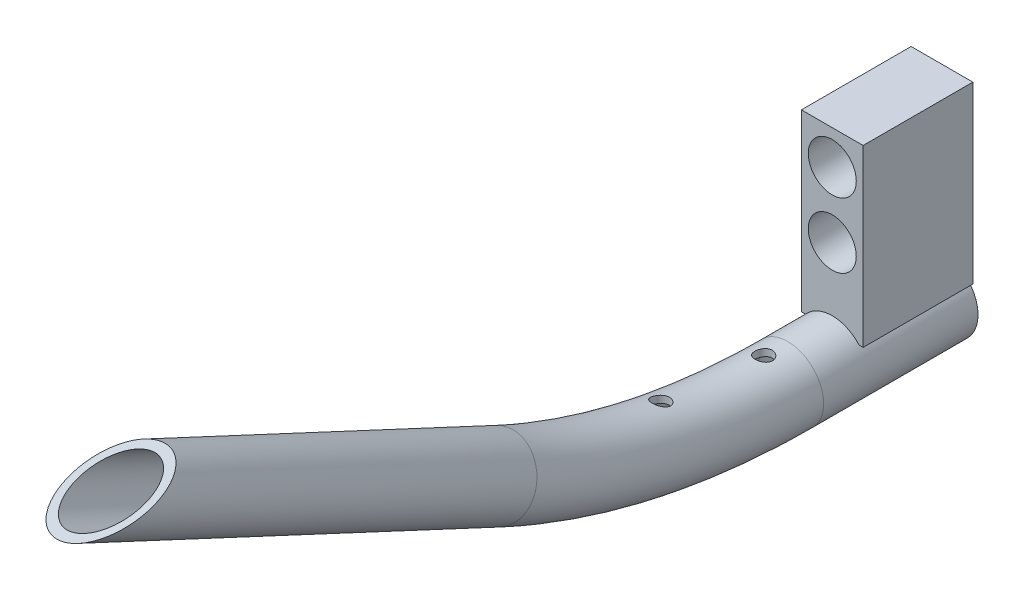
ISO-10303-21;
HEADER;
FILE_DESCRIPTION(('STEP AP214'),'2;1');
FILE_NAME('part.step','',(''),(''),'','','');
FILE_SCHEMA(('AUTOMOTIVE_DESIGN { 1 0 10303 214 1 1 1 1 }'));
ENDSEC;
DATA;
#1=APPLICATION_CONTEXT('core data for automotive mechanical design processes');
#2=APPLICATION_PROTOCOL_DEFINITION('international standard','automotive_design',2000,#1);
#3=PRODUCT_CONTEXT('',#1,'mechanical');
#4=PRODUCT('Part','Part','',(#3));
#5=PRODUCT_RELATED_PRODUCT_CATEGORY('part','',(#4));
#6=PRODUCT_DEFINITION_FORMATION('','',#4);
#7=PRODUCT_DEFINITION_CONTEXT('part definition',#1,'design');
#8=PRODUCT_DEFINITION('design','',#6,#7);
#9=PRODUCT_DEFINITION_SHAPE('','',#8);
#10=(LENGTH_UNIT() NAMED_UNIT(*) SI_UNIT(.MILLI.,.METRE.));
#11=(NAMED_UNIT(*) PLANE_ANGLE_UNIT() SI_UNIT($,.RADIAN.));
#12=(NAMED_UNIT(*) SI_UNIT($,.STERADIAN.) SOLID_ANGLE_UNIT());
#13=UNCERTAINTY_MEASURE_WITH_UNIT(LENGTH_MEASURE(1.E-05),#10,'distance_accuracy_value','');
#14=(GEOMETRIC_REPRESENTATION_CONTEXT(3) GLOBAL_UNCERTAINTY_ASSIGNED_CONTEXT((#13)) GLOBAL_UNIT_ASSIGNED_CONTEXT((#10,
#11,#12)) REPRESENTATION_CONTEXT('',''));
#15=CARTESIAN_POINT('',(0.,0.,0.));
#16=DIRECTION('',(0.,0.,1.));
#17=DIRECTION('',(1.,0.,0.));
#18=AXIS2_PLACEMENT_3D('',#15,#16,#17);
#19=CARTESIAN_POINT('',(0.,29.,32.));
#20=DIRECTION('',(0.,0.,-1.));
#21=DIRECTION('',(-1.,0.,0.));
#22=AXIS2_PLACEMENT_3D('',#19,#20,#21);
#23=CYLINDRICAL_SURFACE('',#22,4.25);
#24=CARTESIAN_POINT('',(0.,29.,0.));
#25=DIRECTION('',(0.,0.,-1.));
#26=DIRECTION('',(-1.,0.,0.));
#27=AXIS2_PLACEMENT_3D('',#24,#25,#26);
#28=CIRCLE('',#27,4.25);
#29=CARTESIAN_POINT('',(-4.25,29.,0.));
#30=VERTEX_POINT('',#29);
#31=EDGE_CURVE('E418',#30,#30,#28,.T.);
#32=ORIENTED_EDGE('',*,*,#31,.T.);
#33=EDGE_LOOP('',(#32));
#34=FACE_BOUND('',#33,.T.);
#35=CARTESIAN_POINT('',(0.,29.,21.));
#36=DIRECTION('',(0.,0.,1.));
#37=DIRECTION('',(1.,0.,0.));
#38=AXIS2_PLACEMENT_3D('',#35,#36,#37);
#39=CIRCLE('',#38,4.25);
#40=CARTESIAN_POINT('',(4.25,29.,21.));
#41=VERTEX_POINT('',#40);
#42=EDGE_CURVE('E39',#41,#41,#39,.F.);
#43=ORIENTED_EDGE('',*,*,#42,.F.);
#44=EDGE_LOOP('',(#43));
#45=FACE_BOUND('',#44,.T.);
#46=ADVANCED_FACE('F35',(#34,#45),#23,.F.);
#47=CARTESIAN_POINT('',(0.,48.,32.));
#48=DIRECTION('',(0.,0.,-1.));
#49=DIRECTION('',(-1.,0.,0.));
#50=AXIS2_PLACEMENT_3D('',#47,#48,#49);
#51=CYLINDRICAL_SURFACE('',#50,4.25);
#52=CARTESIAN_POINT('',(0.,48.,0.));
#53=DIRECTION('',(0.,0.,-1.));
#54=DIRECTION('',(-1.,0.,0.));
#55=AXIS2_PLACEMENT_3D('',#52,#53,#54);
#56=CIRCLE('',#55,4.25);
#57=CARTESIAN_POINT('',(-4.25,48.,0.));
#58=VERTEX_POINT('',#57);
#59=EDGE_CURVE('E126',#58,#58,#56,.T.);
#60=ORIENTED_EDGE('',*,*,#59,.T.);
#61=EDGE_LOOP('',(#60));
#62=FACE_BOUND('',#61,.T.);
#63=CARTESIAN_POINT('',(0.,48.,21.));
#64=DIRECTION('',(0.,0.,1.));
#65=DIRECTION('',(1.,0.,0.));
#66=AXIS2_PLACEMENT_3D('',#63,#64,#65);
#67=CIRCLE('',#66,4.25);
#68=CARTESIAN_POINT('',(4.25,48.,21.));
#69=VERTEX_POINT('',#68);
#70=EDGE_CURVE('E178',#69,#69,#67,.F.);
#71=ORIENTED_EDGE('',*,*,#70,.F.);
#72=EDGE_LOOP('',(#71));
#73=FACE_BOUND('',#72,.T.);
#74=ADVANCED_FACE('F206',(#62,#73),#51,.F.);
#75=CARTESIAN_POINT('',(0.,200.,45.));
#76=DIRECTION('',(-1.,0.,0.));
#77=DIRECTION('',(0.,0.,1.));
#78=AXIS2_PLACEMENT_3D('',#75,#76,#77);
#79=TOROIDAL_SURFACE('',#78,200.,10.5);
#80=CARTESIAN_POINT('',(-1.39813810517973,13.6514963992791,79.9275111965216));
#81=CARTESIAN_POINT('',(-1.28168632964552,13.6526883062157,79.8489556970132));
#82=CARTESIAN_POINT('',(-1.15856044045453,13.6546418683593,79.7802105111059));
#83=CARTESIAN_POINT('',(-0.902464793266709,13.6587415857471,79.664333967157));
#84=CARTESIAN_POINT('',(-0.769488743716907,13.6608878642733,79.6172165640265));
#85=CARTESIAN_POINT('',(-0.497524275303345,13.6643846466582,79.5459789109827));
#86=CARTESIAN_POINT('',(-0.358537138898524,13.6657353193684,79.5218537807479));
#87=CARTESIAN_POINT('',(-0.0785007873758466,13.6671125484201,79.4972830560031));
#88=CARTESIAN_POINT('',(0.0625481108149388,13.6671393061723,79.4968338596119));
#89=CARTESIAN_POINT('',(0.342558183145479,13.6658600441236,79.5196042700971));
#90=CARTESIAN_POINT('',(0.481521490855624,13.6645554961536,79.5427977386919));
#91=CARTESIAN_POINT('',(0.75358830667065,13.6611234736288,79.612152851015));
#92=CARTESIAN_POINT('',(0.886691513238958,13.6589959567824,79.6583156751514));
#93=CARTESIAN_POINT('',(1.14338690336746,13.6548833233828,79.7723537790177));
#94=CARTESIAN_POINT('',(1.26697083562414,13.6528983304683,79.8402476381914));
#95=CARTESIAN_POINT('',(1.50100723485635,13.6503912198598,79.9958242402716));
#96=CARTESIAN_POINT('',(1.61145962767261,13.6498691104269,80.0835070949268));
#97=CARTESIAN_POINT('',(1.81594445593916,13.6517922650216,80.2760394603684));
#98=CARTESIAN_POINT('',(1.90999729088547,13.6542338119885,80.3808673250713));
#99=CARTESIAN_POINT('',(2.07912017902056,13.6635556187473,80.6046771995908));
#100=CARTESIAN_POINT('',(2.1541927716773,13.6704352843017,80.7236573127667));
#101=CARTESIAN_POINT('',(2.28236825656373,13.6897111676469,80.9704958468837));
#102=CARTESIAN_POINT('',(2.33574869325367,13.7020331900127,81.0982159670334));
#103=CARTESIAN_POINT('',(2.42060941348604,13.7328475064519,81.3600131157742));
#104=CARTESIAN_POINT('',(2.45209144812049,13.7513393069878,81.4940896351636));
#105=CARTESIAN_POINT('',(2.49250774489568,13.7943819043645,81.763657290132));
#106=CARTESIAN_POINT('',(2.501595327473,13.8188902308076,81.8991323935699));
#107=CARTESIAN_POINT('',(2.4979451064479,13.8734217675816,82.1686573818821));
#108=CARTESIAN_POINT('',(2.48520398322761,13.9034458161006,82.3027070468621));
#109=CARTESIAN_POINT('',(2.43805972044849,13.9688062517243,82.5699271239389));
#110=CARTESIAN_POINT('',(2.40302523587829,14.0042737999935,82.7029535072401));
#111=CARTESIAN_POINT('',(2.31204859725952,14.0781205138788,82.9608009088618));
#112=CARTESIAN_POINT('',(2.25609993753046,14.116500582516,83.0856193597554));
#113=CARTESIAN_POINT('',(2.12133130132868,14.1962110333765,83.3306064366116));
#114=CARTESIAN_POINT('',(2.04146028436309,14.2375902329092,83.4501821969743));
#115=CARTESIAN_POINT('',(1.86210416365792,14.3187706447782,83.6742672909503));
#116=CARTESIAN_POINT('',(1.76261423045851,14.3585714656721,83.7787729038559));
#117=CARTESIAN_POINT('',(1.54460152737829,14.4344133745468,83.9712041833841));
#118=CARTESIAN_POINT('',(1.42582162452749,14.4703909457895,84.0588649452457));
#119=CARTESIAN_POINT('',(1.17320381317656,14.5350119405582,84.2125595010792));
#120=CARTESIAN_POINT('',(1.03937310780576,14.5636588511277,84.2786035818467));
#121=CARTESIAN_POINT('',(0.769036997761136,14.6095589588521,84.3829128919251));
#122=CARTESIAN_POINT('',(0.633192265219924,14.6274003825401,84.4226263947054));
#123=CARTESIAN_POINT('',(0.35583664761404,14.652673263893,84.4785797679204));
#124=CARTESIAN_POINT('',(0.214329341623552,14.6601111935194,84.4948342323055));
#125=CARTESIAN_POINT('',(-0.0581741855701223,14.663721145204,84.5027392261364));
#126=CARTESIAN_POINT('',(-0.189109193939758,14.6607438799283,84.4962475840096));
#127=CARTESIAN_POINT('',(-0.447825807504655,14.6456389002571,84.4630178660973));
#128=CARTESIAN_POINT('',(-0.57560762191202,14.6335117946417,84.4362811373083));
#129=CARTESIAN_POINT('',(-0.822876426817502,14.6012950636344,84.3641610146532));
#130=CARTESIAN_POINT('',(-0.942449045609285,14.5813099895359,84.319022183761));
#131=CARTESIAN_POINT('',(-1.17231403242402,14.5348133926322,84.2117368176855));
#132=CARTESIAN_POINT('',(-1.28260419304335,14.5083003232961,84.149586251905));
#133=CARTESIAN_POINT('',(-1.49829507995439,14.4486205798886,84.0057310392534));
#134=CARTESIAN_POINT('',(-1.60295139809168,14.4151402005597,83.9230420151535));
#135=CARTESIAN_POINT('',(-1.79728431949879,14.3448579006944,83.7427999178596));
#136=CARTESIAN_POINT('',(-1.88695470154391,14.30805461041,83.645240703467));
#137=CARTESIAN_POINT('',(-2.0560521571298,14.2302875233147,83.4293005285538));
#138=CARTESIAN_POINT('',(-2.13411570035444,14.1892243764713,83.3098847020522));
#139=CARTESIAN_POINT('',(-2.268987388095,14.1082006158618,83.059225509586));
#140=CARTESIAN_POINT('',(-2.32579094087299,14.068240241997,82.9279795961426));
#141=CARTESIAN_POINT('',(-2.41751907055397,13.9907620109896,82.653482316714));
#142=CARTESIAN_POINT('',(-2.4518749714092,13.9533277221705,82.5100159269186));
#143=CARTESIAN_POINT('',(-2.49484587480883,13.8840642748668,82.2179627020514));
#144=CARTESIAN_POINT('',(-2.50346943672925,13.8522332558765,82.069377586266));
#145=CARTESIAN_POINT('',(-2.49420329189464,13.7967556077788,81.7779585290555));
#146=CARTESIAN_POINT('',(-2.47741078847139,13.7728216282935,81.635144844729));
#147=CARTESIAN_POINT('',(-2.41925256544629,13.7318592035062,81.3535747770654));
#148=CARTESIAN_POINT('',(-2.37789067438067,13.7148296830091,81.2148177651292));
#149=CARTESIAN_POINT('',(-2.27399225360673,13.6879819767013,80.9521445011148));
#150=CARTESIAN_POINT('',(-2.21250884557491,13.677870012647,80.8278399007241));
#151=CARTESIAN_POINT('',(-2.06969745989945,13.6627532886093,80.5909376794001));
#152=CARTESIAN_POINT('',(-1.98838148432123,13.6577454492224,80.4783330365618));
#153=CARTESIAN_POINT('',(-1.82545092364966,13.6521350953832,80.2881904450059));
#154=CARTESIAN_POINT('',(-1.74685324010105,13.6508743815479,80.2080610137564));
#155=CARTESIAN_POINT('',(-1.57963152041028,13.6500797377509,80.0590447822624));
#156=CARTESIAN_POINT('',(-1.49100714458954,13.6505458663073,79.9901583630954));
#157=CARTESIAN_POINT('',(-1.39813810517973,13.6514963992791,79.9275111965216));
#158=B_SPLINE_CURVE_WITH_KNOTS('',3,(#80,#81,#82,#83,#84,#85,#86,#87,#88,#89,#90,#91,#92,#93,
#94,#95,#96,#97,#98,#99,#100,#101,#102,#103,#104,#105,#106,#107,#108,#109,#110,#111,#112,#113,
#114,#115,#116,#117,#118,#119,#120,#121,#122,#123,#124,#125,#126,#127,#128,#129,#130,#131,#132,
#133,#134,#135,#136,#137,#138,#139,#140,#141,#142,#143,#144,#145,#146,#147,#148,#149,#150,#151,
#152,#153,#154,#155,#156,#157),.UNSPECIFIED.,.T.,.F.,(4,2,2,2,2,2,2,2,2,2,2,2,2,2,2,2,2,2,2,2,2,
2,2,2,2,2,2,2,2,2,2,2,2,2,2,2,2,2,4),(0.,0.421023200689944,0.842317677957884,1.26352271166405,
1.68466366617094,2.10533953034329,2.52603701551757,2.94709515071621,3.36815566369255,
3.78868862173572,4.20916528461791,4.62407850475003,5.03895854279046,5.45099017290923,
5.8630844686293,6.28740262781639,6.71185288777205,7.15869938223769,7.60565601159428,
8.05915098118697,8.51242982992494,8.93806984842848,9.36344496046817,9.75491488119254,
10.1463587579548,10.5327616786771,10.9192562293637,11.330071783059,11.7410574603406,
12.1844213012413,12.6278808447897,13.0821789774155,13.5363259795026,13.971418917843,
14.4064440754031,14.8216050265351,15.236515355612,15.5722654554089,15.9080269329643),.UNSPECIFIED.);
#159=CARTESIAN_POINT('',(-1.39813810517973,13.6514963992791,79.9275111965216));
#160=VERTEX_POINT('',#159);
#161=EDGE_CURVE('E152',#160,#160,#158,.T.);
#162=ORIENTED_EDGE('',*,*,#161,.T.);
#163=EDGE_LOOP('',(#162));
#164=FACE_BOUND('',#163,.T.);
#165=CARTESIAN_POINT('',(0.,0.,45.));
#166=DIRECTION('',(0.,0.,1.));
#167=DIRECTION('',(1.,0.,0.));
#168=AXIS2_PLACEMENT_3D('',#165,#166,#167);
#169=CIRCLE('',#168,10.5);
#170=CARTESIAN_POINT('',(10.5,0.,45.));
#171=VERTEX_POINT('',#170);
#172=EDGE_CURVE('E401',#171,#171,#169,.T.);
#173=ORIENTED_EDGE('',*,*,#172,.T.);
#174=EDGE_LOOP('',(#173));
#175=FACE_BOUND('',#174,.T.);
#176=CARTESIAN_POINT('',(0.,18.73844259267,129.52365234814));
#177=DIRECTION('',(0.,0.4226182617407,0.90630778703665));
#178=DIRECTION('',(1.,0.,0.));
#179=AXIS2_PLACEMENT_3D('',#176,#177,#178);
#180=CIRCLE('',#179,10.5);
#181=CARTESIAN_POINT('',(10.5,18.73844259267,129.52365234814));
#182=VERTEX_POINT('',#181);
#183=EDGE_CURVE('E11',#182,#182,#180,.T.);
#184=ORIENTED_EDGE('',*,*,#183,.F.);
#185=EDGE_LOOP('',(#184));
#186=FACE_BOUND('',#185,.T.);
#187=CARTESIAN_POINT('',(-1.4336009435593,10.4663494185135,49.9518817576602));
#188=CARTESIAN_POINT('',(-1.3198313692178,10.4799526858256,49.872251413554));
#189=CARTESIAN_POINT('',(-1.19932579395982,10.4928678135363,49.8020554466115));
#190=CARTESIAN_POINT('',(-0.948055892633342,10.5157140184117,49.6825539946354));
#191=CARTESIAN_POINT('',(-0.817287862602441,10.5256440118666,49.6332560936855));
#192=CARTESIAN_POINT('',(-0.549032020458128,10.5412908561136,49.5570484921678));
#193=CARTESIAN_POINT('',(-0.411539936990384,10.5470049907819,49.5301532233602));
#194=CARTESIAN_POINT('',(-0.133896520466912,10.5534936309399,49.4996859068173));
#195=CARTESIAN_POINT('',(0.00625436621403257,10.5542689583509,49.4961099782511));
#196=CARTESIAN_POINT('',(0.283272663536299,10.550809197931,49.5122793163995));
#197=CARTESIAN_POINT('',(0.420158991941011,10.5466401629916,49.5317171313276));
#198=CARTESIAN_POINT('',(0.688672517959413,10.5339099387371,49.5927836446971));
#199=CARTESIAN_POINT('',(0.820299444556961,10.5253485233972,49.6344134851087));
#200=CARTESIAN_POINT('',(1.07518301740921,10.5048304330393,49.738800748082));
#201=CARTESIAN_POINT('',(1.19840581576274,10.4928609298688,49.8016381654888));
#202=CARTESIAN_POINT('',(1.4326961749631,10.4669944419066,49.9466207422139));
#203=CARTESIAN_POINT('',(1.5437620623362,10.453097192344,50.0287685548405));
#204=CARTESIAN_POINT('',(1.7529762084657,10.4248018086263,50.2120394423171));
#205=CARTESIAN_POINT('',(1.85081594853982,10.4103992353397,50.3135143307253));
#206=CARTESIAN_POINT('',(2.02817990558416,10.3832894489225,50.5315861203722));
#207=CARTESIAN_POINT('',(2.10770367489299,10.3705822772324,50.6481833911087));
#208=CARTESIAN_POINT('',(2.24630023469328,10.3486671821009,50.8936363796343));
#209=CARTESIAN_POINT('',(2.30532560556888,10.339467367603,51.0225196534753));
#210=CARTESIAN_POINT('',(2.40081780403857,10.3261361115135,51.2886303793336));
#211=CARTESIAN_POINT('',(2.43728912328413,10.3220036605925,51.4258561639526));
#212=CARTESIAN_POINT('',(2.4859163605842,10.319798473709,51.7011837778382));
#213=CARTESIAN_POINT('',(2.4986368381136,10.321582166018,51.8391848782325));
#214=CARTESIAN_POINT('',(2.50115489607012,10.3311171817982,52.1151794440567));
#215=CARTESIAN_POINT('',(2.49095412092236,10.3388680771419,52.253172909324));
#216=CARTESIAN_POINT('',(2.44835517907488,10.3597152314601,52.5235035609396));
#217=CARTESIAN_POINT('',(2.41623092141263,10.3727447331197,52.6558893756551));
#218=CARTESIAN_POINT('',(2.33116145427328,10.4030692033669,52.9132714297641));
#219=CARTESIAN_POINT('',(2.27821336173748,10.4203647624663,53.0382666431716));
#220=CARTESIAN_POINT('',(2.15157132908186,10.4581549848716,53.2805731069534));
#221=CARTESIAN_POINT('',(2.07741747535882,10.4787154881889,53.3976335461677));
#222=CARTESIAN_POINT('',(1.91093344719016,10.5208374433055,53.6178360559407));
#223=CARTESIAN_POINT('',(1.81859976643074,10.5423990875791,53.7209754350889));
#224=CARTESIAN_POINT('',(1.61527505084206,10.5851161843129,53.9133770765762));
#225=CARTESIAN_POINT('',(1.50383662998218,10.6062436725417,54.0021737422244));
#226=CARTESIAN_POINT('',(1.26711416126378,10.6453459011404,54.1597767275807));
#227=CARTESIAN_POINT('',(1.14183092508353,10.6633208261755,54.2285842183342));
#228=CARTESIAN_POINT('',(0.882120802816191,10.6941155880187,54.3434636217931));
#229=CARTESIAN_POINT('',(0.747795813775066,10.70698432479,54.389752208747));
#230=CARTESIAN_POINT('',(0.472827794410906,10.7264570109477,54.458967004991));
#231=CARTESIAN_POINT('',(0.332186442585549,10.7330626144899,54.4818993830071));
#232=CARTESIAN_POINT('',(0.0539481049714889,10.7391870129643,54.5031708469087));
#233=CARTESIAN_POINT('',(-0.083579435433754,10.7389493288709,54.5023550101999));
#234=CARTESIAN_POINT('',(-0.356472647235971,10.7320132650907,54.4782427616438));
#235=CARTESIAN_POINT('',(-0.491838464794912,10.7253153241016,54.4549478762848));
#236=CARTESIAN_POINT('',(-0.754984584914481,10.706250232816,54.3871007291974));
#237=CARTESIAN_POINT('',(-0.88283527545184,10.6939505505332,54.3428011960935));
#238=CARTESIAN_POINT('',(-1.12931990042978,10.664881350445,54.2344503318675));
#239=CARTESIAN_POINT('',(-1.24795251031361,10.6481111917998,54.1703961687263));
#240=CARTESIAN_POINT('',(-1.47619674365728,10.6111395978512,54.0223385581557));
#241=CARTESIAN_POINT('',(-1.58547034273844,10.5908564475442,53.9378347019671));
#242=CARTESIAN_POINT('',(-1.78854439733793,10.5490959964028,53.7521550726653));
#243=CARTESIAN_POINT('',(-1.88234161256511,10.5276184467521,53.6509758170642));
#244=CARTESIAN_POINT('',(-2.05471042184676,10.4848013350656,53.4311725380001));
#245=CARTESIAN_POINT('',(-2.13273149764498,10.4634858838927,53.3121111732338));
#246=CARTESIAN_POINT('',(-2.26762200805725,10.4237563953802,53.0621021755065));
#247=CARTESIAN_POINT('',(-2.32449250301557,10.4053422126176,52.9311551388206));
#248=CARTESIAN_POINT('',(-2.41491999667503,10.3733071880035,52.6619457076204));
#249=CARTESIAN_POINT('',(-2.44864401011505,10.3596523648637,52.5237436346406));
#250=CARTESIAN_POINT('',(-2.49218697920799,10.3381829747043,52.2431912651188));
#251=CARTESIAN_POINT('',(-2.5020119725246,10.3303669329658,52.100842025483));
#252=CARTESIAN_POINT('',(-2.49737849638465,10.3212342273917,51.8209548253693));
#253=CARTESIAN_POINT('',(-2.4836949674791,10.3197155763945,51.6834101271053));
#254=CARTESIAN_POINT('',(-2.43388724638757,10.3223666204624,51.4124963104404));
#255=CARTESIAN_POINT('',(-2.39776171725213,10.3265366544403,51.2791274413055));
#256=CARTESIAN_POINT('',(-2.30457426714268,10.3395994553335,51.0214498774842));
#257=CARTESIAN_POINT('',(-2.24768896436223,10.3484526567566,50.8970750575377));
#258=CARTESIAN_POINT('',(-2.11460540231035,10.3694860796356,50.6594872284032));
#259=CARTESIAN_POINT('',(-2.03841306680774,10.3816652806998,50.5462708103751));
#260=CARTESIAN_POINT('',(-1.87914893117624,10.4061123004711,50.3468048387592));
#261=CARTESIAN_POINT('',(-1.79804516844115,10.4181886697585,50.2589503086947));
#262=CARTESIAN_POINT('',(-1.62415290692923,10.4424625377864,50.0957019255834));
#263=CARTESIAN_POINT('',(-1.53136388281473,10.4546600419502,50.0203086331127));
#264=CARTESIAN_POINT('',(-1.4336009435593,10.4663494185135,49.9518817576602));
#265=B_SPLINE_CURVE_WITH_KNOTS('',3,(#187,#188,#189,#190,#191,#192,#193,#194,#195,#196,#197,
#198,#199,#200,#201,#202,#203,#204,#205,#206,#207,#208,#209,#210,#211,#212,#213,#214,#215,#216,
#217,#218,#219,#220,#221,#222,#223,#224,#225,#226,#227,#228,#229,#230,#231,#232,#233,#234,#235,
#236,#237,#238,#239,#240,#241,#242,#243,#244,#245,#246,#247,#248,#249,#250,#251,#252,#253,#254,
#255,#256,#257,#258,#259,#260,#261,#262,#263,#264),.UNSPECIFIED.,.T.,.F.,(4,2,2,2,2,2,2,2,2,2,2,
2,2,2,2,2,2,2,2,2,2,2,2,2,2,2,2,2,2,2,2,2,2,2,2,2,2,2,4),(0.,0.418182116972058,
0.836515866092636,1.25511889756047,1.67365226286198,2.08665675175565,2.49968249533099,
2.91428391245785,3.32894233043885,3.75203072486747,4.17512945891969,4.59920054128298,
5.0231871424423,5.4369605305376,5.85070423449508,6.25937109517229,6.66809455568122,
7.08645944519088,7.50490510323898,7.93498573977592,8.36504117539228,8.79087253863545,
9.21659140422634,9.62718026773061,10.0377412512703,10.4434830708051,10.849283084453,
11.2662486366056,11.6833013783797,12.1130519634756,12.5427810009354,12.9693757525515,
13.3958627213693,13.8085591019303,14.2212800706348,14.6305686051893,15.0397317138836,
15.3990621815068,15.7584088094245),.UNSPECIFIED.);
#266=CARTESIAN_POINT('',(-1.4336009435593,10.4663494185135,49.9518817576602));
#267=VERTEX_POINT('',#266);
#268=EDGE_CURVE('E144',#267,#267,#265,.T.);
#269=ORIENTED_EDGE('',*,*,#268,.T.);
#270=EDGE_LOOP('',(#269));
#271=FACE_BOUND('',#270,.T.);
#272=ADVANCED_FACE('F157',(#164,#175,#186,#271),#79,.T.);
#273=CARTESIAN_POINT('',(0.,200.,45.));
#274=DIRECTION('',(-1.,0.,0.));
#275=DIRECTION('',(0.,0.,1.));
#276=AXIS2_PLACEMENT_3D('',#273,#274,#275);
#277=TOROIDAL_SURFACE('',#276,200.,8.5);
#278=CARTESIAN_POINT('',(-1.39771725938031,11.5944067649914,79.9272273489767));
#279=CARTESIAN_POINT('',(-1.28139554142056,11.5995859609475,79.8487919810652));
#280=CARTESIAN_POINT('',(-1.15844737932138,11.6052058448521,79.7801616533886));
#281=CARTESIAN_POINT('',(-0.902732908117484,11.6156400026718,79.6644529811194));
#282=CARTESIAN_POINT('',(-0.769963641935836,11.6204540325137,79.6173811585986));
#283=CARTESIAN_POINT('',(-0.498329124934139,11.6280378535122,79.5461497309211));
#284=CARTESIAN_POINT('',(-0.359463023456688,11.6308073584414,79.5219933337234));
#285=CARTESIAN_POINT('',(-0.0796323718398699,11.6336377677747,79.497324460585));
#286=CARTESIAN_POINT('',(0.0613319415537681,11.6336989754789,79.4968093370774));
#287=CARTESIAN_POINT('',(0.34064523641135,11.6311059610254,79.5193753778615));
#288=CARTESIAN_POINT('',(0.479003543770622,11.6284648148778,79.5423429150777));
#289=CARTESIAN_POINT('',(0.749898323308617,11.621111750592,79.6110293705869));
#290=CARTESIAN_POINT('',(0.882434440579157,11.6163997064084,79.6567496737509));
#291=CARTESIAN_POINT('',(1.13832107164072,11.6060859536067,79.7697891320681));
#292=CARTESIAN_POINT('',(1.26164701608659,11.6004819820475,79.8371636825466));
#293=CARTESIAN_POINT('',(1.4953261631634,11.590047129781,79.9916136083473));
#294=CARTESIAN_POINT('',(1.60567858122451,11.5852162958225,80.0786901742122));
#295=CARTESIAN_POINT('',(1.8107045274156,11.5782462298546,80.2705117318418));
#296=CARTESIAN_POINT('',(1.90531615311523,11.5761174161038,80.3753233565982));
#297=CARTESIAN_POINT('',(2.07556603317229,11.5765856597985,80.5993540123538));
#298=CARTESIAN_POINT('',(2.15120772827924,11.5791818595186,80.7185704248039));
#299=CARTESIAN_POINT('',(2.28009142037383,11.5907241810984,80.9654860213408));
#300=CARTESIAN_POINT('',(2.33371962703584,11.599552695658,81.0929889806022));
#301=CARTESIAN_POINT('',(2.4191174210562,11.624501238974,81.3544196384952));
#302=CARTESIAN_POINT('',(2.45089096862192,11.6406199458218,81.4883461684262));
#303=CARTESIAN_POINT('',(2.49163385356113,11.6799962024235,81.7557068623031));
#304=CARTESIAN_POINT('',(2.50105566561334,11.7031012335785,81.8890952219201));
#305=CARTESIAN_POINT('',(2.49875565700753,11.7559800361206,82.1543414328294));
#306=CARTESIAN_POINT('',(2.48703056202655,11.7857548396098,82.2861990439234));
#307=CARTESIAN_POINT('',(2.44275383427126,11.8516486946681,82.5488100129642));
#308=CARTESIAN_POINT('',(2.4096177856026,11.8879244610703,82.6794246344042));
#309=CARTESIAN_POINT('',(2.32336336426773,11.9643344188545,82.9326825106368));
#310=CARTESIAN_POINT('',(2.27023776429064,12.0044700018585,83.0553228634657));
#311=CARTESIAN_POINT('',(2.14106930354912,12.0893092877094,83.2984948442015));
#312=CARTESIAN_POINT('',(2.06367331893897,12.1341354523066,83.4182663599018));
#313=CARTESIAN_POINT('',(1.88945662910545,12.2228053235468,83.6432305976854));
#314=CARTESIAN_POINT('',(1.79262809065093,12.2666486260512,83.748417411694));
#315=CARTESIAN_POINT('',(1.57807213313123,12.3516185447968,83.9446030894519));
#316=CARTESIAN_POINT('',(1.4597743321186,12.3926130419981,84.0350391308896));
#317=CARTESIAN_POINT('',(1.20721319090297,12.4667956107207,84.1942844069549));
#318=CARTESIAN_POINT('',(1.07295855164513,12.4999879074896,84.2631053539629));
#319=CARTESIAN_POINT('',(0.801676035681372,12.5534596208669,84.3721776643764));
#320=CARTESIAN_POINT('',(0.665439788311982,12.5744564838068,84.4140371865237));
#321=CARTESIAN_POINT('',(0.386614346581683,12.6047408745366,84.4740280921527));
#322=CARTESIAN_POINT('',(0.244030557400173,12.6140381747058,84.4921792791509));
#323=CARTESIAN_POINT('',(-0.0279801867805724,12.6196587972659,84.5031708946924));
#324=CARTESIAN_POINT('',(-0.15729323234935,12.6171892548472,84.4983661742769));
#325=CARTESIAN_POINT('',(-0.41304495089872,12.6022270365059,84.4689987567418));
#326=CARTESIAN_POINT('',(-0.539483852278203,12.5897351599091,84.4444376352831));
#327=CARTESIAN_POINT('',(-0.783414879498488,12.5561452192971,84.3773820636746));
#328=CARTESIAN_POINT('',(-0.901037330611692,12.535228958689,84.335265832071));
#329=CARTESIAN_POINT('',(-1.12750699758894,12.4863600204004,84.2347459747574));
#330=CARTESIAN_POINT('',(-1.23635198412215,12.4584055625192,84.1763382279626));
#331=CARTESIAN_POINT('',(-1.45097565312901,12.3950048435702,84.0401002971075));
#332=CARTESIAN_POINT('',(-1.55592037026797,12.3591553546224,83.9611465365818));
#333=CARTESIAN_POINT('',(-1.75152455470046,12.2838025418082,83.7886278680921));
#334=CARTESIAN_POINT('',(-1.84217690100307,12.2442974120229,83.6950557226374));
#335=CARTESIAN_POINT('',(-2.0157791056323,12.1600378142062,83.4855628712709));
#336=CARTESIAN_POINT('',(-2.09711125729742,12.1151475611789,83.3683519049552));
#337=CARTESIAN_POINT('',(-2.23891019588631,12.0267245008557,83.1214107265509));
#338=CARTESIAN_POINT('',(-2.29937076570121,11.9831921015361,82.9916767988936));
#339=CARTESIAN_POINT('',(-2.39906953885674,11.8989650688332,82.718491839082));
#340=CARTESIAN_POINT('',(-2.43760742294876,11.8583967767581,82.5747438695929));
#341=CARTESIAN_POINT('',(-2.48862489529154,11.7842199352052,82.2809635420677));
#342=CARTESIAN_POINT('',(-2.50111759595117,11.7506078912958,82.1309343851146));
#343=CARTESIAN_POINT('',(-2.49879418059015,11.6938209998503,81.8381106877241));
#344=CARTESIAN_POINT('',(-2.48551662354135,11.67015470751,81.6953999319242));
#345=CARTESIAN_POINT('',(-2.43439675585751,11.6311452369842,81.4132795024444));
#346=CARTESIAN_POINT('',(-2.39656158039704,11.6157996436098,81.2738688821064));
#347=CARTESIAN_POINT('',(-2.30010524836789,11.5936011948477,81.0110829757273));
#348=CARTESIAN_POINT('',(-2.24283386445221,11.5863028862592,80.8872467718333));
#349=CARTESIAN_POINT('',(-2.10881872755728,11.5774614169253,80.6504129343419));
#350=CARTESIAN_POINT('',(-2.03207958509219,11.5759168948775,80.5374127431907));
#351=CARTESIAN_POINT('',(-1.86842248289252,11.576899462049,80.3342953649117));
#352=CARTESIAN_POINT('',(-1.78288802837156,11.5790975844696,80.2430555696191));
#353=CARTESIAN_POINT('',(-1.59921987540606,11.58554992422,80.0743711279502));
#354=CARTESIAN_POINT('',(-1.50108493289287,11.5898043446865,79.9969278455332));
#355=CARTESIAN_POINT('',(-1.39771725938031,11.5944067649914,79.9272273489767));
#356=B_SPLINE_CURVE_WITH_KNOTS('',3,(#278,#279,#280,#281,#282,#283,#284,#285,#286,#287,#288,
#289,#290,#291,#292,#293,#294,#295,#296,#297,#298,#299,#300,#301,#302,#303,#304,#305,#306,#307,
#308,#309,#310,#311,#312,#313,#314,#315,#316,#317,#318,#319,#320,#321,#322,#323,#324,#325,#326,
#327,#328,#329,#330,#331,#332,#333,#334,#335,#336,#337,#338,#339,#340,#341,#342,#343,#344,#345,
#346,#347,#348,#349,#350,#351,#352,#353,#354,#355),.UNSPECIFIED.,.T.,.F.,(4,2,2,2,2,2,2,2,2,2,2,
2,2,2,2,2,2,2,2,2,2,2,2,2,2,2,2,2,2,2,2,2,2,2,2,2,2,2,4),(0.,0.420729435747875,
0.841586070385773,1.2625016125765,1.68337001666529,2.10221153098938,2.52107854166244,
2.94102573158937,3.36099830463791,3.78258530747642,4.20409578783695,4.61785768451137,
5.03154458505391,5.43678281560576,5.84208379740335,6.25894356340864,6.67595419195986,
7.12240475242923,7.56903563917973,8.02998212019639,8.49067839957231,8.92043813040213,
9.3498386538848,9.73619438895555,10.1225193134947,10.5009192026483,10.8794148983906,
11.286136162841,11.6930594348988,12.1397370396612,12.5865475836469,13.0469283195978,
13.5070772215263,13.9405966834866,14.3739902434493,14.7819561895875,15.1898256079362,
15.563664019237,15.9375393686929),.UNSPECIFIED.);
#357=CARTESIAN_POINT('',(-1.39771725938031,11.5944067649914,79.9272273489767));
#358=VERTEX_POINT('',#357);
#359=EDGE_CURVE('E151',#358,#358,#356,.T.);
#360=ORIENTED_EDGE('',*,*,#359,.F.);
#361=EDGE_LOOP('',(#360));
#362=FACE_BOUND('',#361,.T.);
#363=CARTESIAN_POINT('',(0.,0.,45.));
#364=DIRECTION('',(0.,0.,1.));
#365=DIRECTION('',(1.,0.,0.));
#366=AXIS2_PLACEMENT_3D('',#363,#364,#365);
#367=CIRCLE('',#366,8.5);
#368=CARTESIAN_POINT('',(0.,8.49999999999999,45.));
#369=VERTEX_POINT('',#368);
#370=EDGE_CURVE('E398',#369,#369,#367,.T.);
#371=ORIENTED_EDGE('',*,*,#370,.F.);
#372=EDGE_LOOP('',(#371));
#373=FACE_BOUND('',#372,.T.);
#374=CARTESIAN_POINT('',(0.,18.73844259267,129.52365234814));
#375=DIRECTION('',(0.,0.4226182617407,0.90630778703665));
#376=DIRECTION('',(1.,0.,0.));
#377=AXIS2_PLACEMENT_3D('',#374,#375,#376);
#378=CIRCLE('',#377,8.5);
#379=CARTESIAN_POINT('',(8.5,18.73844259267,129.52365234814));
#380=VERTEX_POINT('',#379);
#381=EDGE_CURVE('E44',#380,#380,#378,.T.);
#382=ORIENTED_EDGE('',*,*,#381,.T.);
#383=EDGE_LOOP('',(#382));
#384=FACE_BOUND('',#383,.T.);
#385=CARTESIAN_POINT('',(-1.51899508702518,8.4287872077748,50.0143882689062));
#386=CARTESIAN_POINT('',(-1.40909951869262,8.4465524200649,49.9303197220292));
#387=CARTESIAN_POINT('',(-1.2921331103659,8.46364478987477,49.8553273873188));
#388=CARTESIAN_POINT('',(-1.04704058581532,8.49445652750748,49.725592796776));
#389=CARTESIAN_POINT('',(-0.918914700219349,8.50817596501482,49.6708501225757));
#390=CARTESIAN_POINT('',(-0.654762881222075,8.53062474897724,49.5832528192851));
#391=CARTESIAN_POINT('',(-0.518726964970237,8.53934763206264,49.550426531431));
#392=CARTESIAN_POINT('',(-0.242843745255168,8.55071494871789,49.5079128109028));
#393=CARTESIAN_POINT('',(-0.102997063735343,8.55336036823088,49.4982216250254));
#394=CARTESIAN_POINT('',(0.173247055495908,8.55226501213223,49.5022709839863));
#395=CARTESIAN_POINT('',(0.30965283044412,8.54866312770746,49.515501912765));
#396=CARTESIAN_POINT('',(0.578212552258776,8.53576382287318,49.5639600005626));
#397=CARTESIAN_POINT('',(0.710366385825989,8.52646625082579,49.5991877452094));
#398=CARTESIAN_POINT('',(0.966832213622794,8.50324951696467,49.6905038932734));
#399=CARTESIAN_POINT('',(1.09114269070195,8.48932946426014,49.7465963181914));
#400=CARTESIAN_POINT('',(1.32874251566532,8.45845347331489,49.8780002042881));
#401=CARTESIAN_POINT('',(1.44202976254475,8.44149695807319,49.9533153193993));
#402=CARTESIAN_POINT('',(1.65812830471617,8.40593121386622,50.1237983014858));
#403=CARTESIAN_POINT('',(1.76050522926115,8.3872870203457,50.2195098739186));
#404=CARTESIAN_POINT('',(1.94796475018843,8.35112913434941,50.4267980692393));
#405=CARTESIAN_POINT('',(2.03304521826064,8.33361558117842,50.5383766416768));
#406=CARTESIAN_POINT('',(2.18450550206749,8.30183592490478,50.7760565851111));
#407=CARTESIAN_POINT('',(2.25063464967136,8.28761379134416,50.9023240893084));
#408=CARTESIAN_POINT('',(2.36060887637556,8.26486606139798,51.1646903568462));
#409=CARTESIAN_POINT('',(2.40446046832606,8.25633879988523,51.3007862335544));
#410=CARTESIAN_POINT('',(2.46733399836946,8.24670084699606,51.5742071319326));
#411=CARTESIAN_POINT('',(2.48711420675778,8.24535886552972,51.7113495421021));
#412=CARTESIAN_POINT('',(2.50377078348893,8.25008251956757,51.9868773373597));
#413=CARTESIAN_POINT('',(2.50065106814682,8.25614688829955,52.1252625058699));
#414=CARTESIAN_POINT('',(2.47218015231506,8.27508679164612,52.3952794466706));
#415=CARTESIAN_POINT('',(2.44745344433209,8.28776699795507,52.5269918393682));
#416=CARTESIAN_POINT('',(2.37756802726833,8.31873869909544,52.7841785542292));
#417=CARTESIAN_POINT('',(2.3324062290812,8.33703104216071,52.9096519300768));
#418=CARTESIAN_POINT('',(2.22165534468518,8.37811861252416,53.1544544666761));
#419=CARTESIAN_POINT('',(2.15556588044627,8.40101850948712,53.273539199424));
#420=CARTESIAN_POINT('',(2.0052113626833,8.44888430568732,53.4991729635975));
#421=CARTESIAN_POINT('',(1.92094112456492,8.4738507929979,53.6057184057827));
#422=CARTESIAN_POINT('',(1.73200158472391,8.52472409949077,53.8083770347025));
#423=CARTESIAN_POINT('',(1.62657350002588,8.55062147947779,53.9037868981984));
#424=CARTESIAN_POINT('',(1.4006562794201,8.59961781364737,54.0756452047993));
#425=CARTESIAN_POINT('',(1.28016681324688,8.62271670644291,54.1520932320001));
#426=CARTESIAN_POINT('',(1.02739473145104,8.66371661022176,54.2835758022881));
#427=CARTESIAN_POINT('',(0.895129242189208,8.68162501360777,54.3386408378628));
#428=CARTESIAN_POINT('',(0.62244312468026,8.71034909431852,54.4254933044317));
#429=CARTESIAN_POINT('',(0.482025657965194,8.72116750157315,54.4572896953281));
#430=CARTESIAN_POINT('',(0.204312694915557,8.73417849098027,54.4953850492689));
#431=CARTESIAN_POINT('',(0.0671936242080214,8.73676219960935,54.5028405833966));
#432=CARTESIAN_POINT('',(-0.206328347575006,8.73414124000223,54.4952231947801));
#433=CARTESIAN_POINT('',(-0.342731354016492,8.7289377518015,54.4801536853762));
#434=CARTESIAN_POINT('',(-0.607210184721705,8.71152585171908,54.428779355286));
#435=CARTESIAN_POINT('',(-0.735410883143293,8.69950667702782,54.3930477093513));
#436=CARTESIAN_POINT('',(-0.983956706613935,8.6697643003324,54.3020321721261));
#437=CARTESIAN_POINT('',(-1.1043007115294,8.65204028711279,54.2467455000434));
#438=CARTESIAN_POINT('',(-1.33774988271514,8.61190789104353,54.1163273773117));
#439=CARTESIAN_POINT('',(-1.45052562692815,8.58937394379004,54.0406458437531));
#440=CARTESIAN_POINT('',(-1.66211355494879,8.54205216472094,53.8723424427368));
#441=CARTESIAN_POINT('',(-1.76092148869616,8.51726365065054,53.7797154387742));
#442=CARTESIAN_POINT('',(-1.94665675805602,8.46648711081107,53.5749685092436));
#443=CARTESIAN_POINT('',(-2.03279365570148,8.44049821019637,53.4621300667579));
#444=CARTESIAN_POINT('',(-2.18497007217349,8.39108142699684,53.2231016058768));
#445=CARTESIAN_POINT('',(-2.25100886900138,8.36765363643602,53.0969111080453));
#446=CARTESIAN_POINT('',(-2.36101129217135,8.32570602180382,52.8342206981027));
#447=CARTESIAN_POINT('',(-2.40494165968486,8.30719361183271,52.6977056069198));
#448=CARTESIAN_POINT('',(-2.46888239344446,8.27703805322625,52.4184660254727));
#449=CARTESIAN_POINT('',(-2.48890208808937,8.26539222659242,52.2757439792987));
#450=CARTESIAN_POINT('',(-2.50375466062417,8.25039014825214,51.9952215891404));
#451=CARTESIAN_POINT('',(-2.49971064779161,8.24667509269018,51.8574992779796));
#452=CARTESIAN_POINT('',(-2.46906559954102,8.24648075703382,51.5845915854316));
#453=CARTESIAN_POINT('',(-2.44246640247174,8.25000088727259,51.4494059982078));
#454=CARTESIAN_POINT('',(-2.36842834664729,8.26325489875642,51.1884997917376));
#455=CARTESIAN_POINT('',(-2.32146867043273,8.27284810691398,51.0626351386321));
#456=CARTESIAN_POINT('',(-2.20825635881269,8.29665094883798,50.8203879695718));
#457=CARTESIAN_POINT('',(-2.14200183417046,8.31086103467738,50.7040063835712));
#458=CARTESIAN_POINT('',(-1.99182970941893,8.3420814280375,50.4832659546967));
#459=CARTESIAN_POINT('',(-1.90786804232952,8.3590986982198,50.3789381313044));
#460=CARTESIAN_POINT('',(-1.72446437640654,8.39388175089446,50.1850523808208));
#461=CARTESIAN_POINT('',(-1.62502052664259,8.41164762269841,50.0954962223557));
#462=CARTESIAN_POINT('',(-1.51899508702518,8.4287872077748,50.0143882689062));
#463=B_SPLINE_CURVE_WITH_KNOTS('',3,(#385,#386,#387,#388,#389,#390,#391,#392,#393,#394,#395,
#396,#397,#398,#399,#400,#401,#402,#403,#404,#405,#406,#407,#408,#409,#410,#411,#412,#413,#414,
#415,#416,#417,#418,#419,#420,#421,#422,#423,#424,#425,#426,#427,#428,#429,#430,#431,#432,#433,
#434,#435,#436,#437,#438,#439,#440,#441,#442,#443,#444,#445,#446,#447,#448,#449,#450,#451,#452,
#453,#454,#455,#456,#457,#458,#459,#460,#461,#462),.UNSPECIFIED.,.T.,.F.,(4,2,2,2,2,2,2,2,2,2,2,
2,2,2,2,2,2,2,2,2,2,2,2,2,2,2,2,2,2,2,2,2,2,2,2,2,2,2,4),(0.,0.418040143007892,
0.836071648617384,1.25464269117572,1.67314582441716,2.08246356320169,2.49179219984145,
2.90119977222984,3.31068522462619,3.73288220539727,4.1551311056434,4.58273137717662,
5.01020656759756,5.42383499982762,5.83739269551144,6.23937880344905,6.64142569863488,
7.05392131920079,7.46653472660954,7.89808732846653,8.32964939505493,8.76059376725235,
9.19137211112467,9.60135878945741,10.0112833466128,10.4103475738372,10.809468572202,
11.2206719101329,11.6320000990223,12.0629277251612,12.4938708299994,12.9254603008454,
13.3568813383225,13.76832988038,14.1797448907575,14.5819623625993,14.9842192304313,
15.3874892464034,15.7908075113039),.UNSPECIFIED.);
#464=CARTESIAN_POINT('',(-1.51899508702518,8.4287872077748,50.0143882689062));
#465=VERTEX_POINT('',#464);
#466=EDGE_CURVE('E137',#465,#465,#463,.T.);
#467=ORIENTED_EDGE('',*,*,#466,.F.);
#468=EDGE_LOOP('',(#467));
#469=FACE_BOUND('',#468,.T.);
#470=ADVANCED_FACE('F179',(#362,#373,#384,#469),#277,.F.);
#471=CARTESIAN_POINT('',(0.,18.73844259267,129.52365234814));
#472=DIRECTION('',(0.,0.4226182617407,0.906307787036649));
#473=DIRECTION('',(0.,-0.906307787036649,0.4226182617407));
#474=AXIS2_PLACEMENT_3D('',#471,#472,#473);
#475=CYLINDRICAL_SURFACE('',#474,10.5);
#476=CARTESIAN_POINT('',(0.,71.3441062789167,242.336862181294));
#477=DIRECTION('',(0.,-0.965925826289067,-0.258819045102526));
#478=DIRECTION('',(0.,-0.258819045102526,0.965925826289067));
#479=AXIS2_PLACEMENT_3D('',#476,#477,#478);
#480=ELLIPSE('',#479,16.3351001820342,10.5);
#481=CARTESIAN_POINT('',(0.,67.1162712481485,258.11535732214));
#482=VERTEX_POINT('',#481);
#483=EDGE_CURVE('E382',#482,#482,#480,.F.);
#484=ORIENTED_EDGE('',*,*,#483,.F.);
#485=EDGE_LOOP('',(#484));
#486=FACE_BOUND('',#485,.T.);
#487=ORIENTED_EDGE('',*,*,#183,.T.);
#488=EDGE_LOOP('',(#487));
#489=FACE_BOUND('',#488,.T.);
#490=ADVANCED_FACE('F37',(#486,#489),#475,.T.);
#491=CARTESIAN_POINT('',(0.,18.73844259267,129.52365234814));
#492=DIRECTION('',(0.,0.4226182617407,0.906307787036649));
#493=DIRECTION('',(0.,-0.906307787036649,0.4226182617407));
#494=AXIS2_PLACEMENT_3D('',#491,#492,#493);
#495=CYLINDRICAL_SURFACE('',#494,8.5);
#496=CARTESIAN_POINT('',(0.,71.3441062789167,242.336862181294));
#497=DIRECTION('',(0.,-0.965925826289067,-0.258819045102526));
#498=DIRECTION('',(0.,-0.258819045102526,0.965925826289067));
#499=AXIS2_PLACEMENT_3D('',#496,#497,#498);
#500=ELLIPSE('',#499,13.2236525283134,8.5);
#501=CARTESIAN_POINT('',(0.,67.921573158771,255.109929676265));
#502=VERTEX_POINT('',#501);
#503=EDGE_CURVE('E391',#502,#502,#500,.F.);
#504=ORIENTED_EDGE('',*,*,#503,.T.);
#505=EDGE_LOOP('',(#504));
#506=FACE_BOUND('',#505,.T.);
#507=ORIENTED_EDGE('',*,*,#381,.F.);
#508=EDGE_LOOP('',(#507));
#509=FACE_BOUND('',#508,.T.);
#510=ADVANCED_FACE('F189',(#506,#509),#495,.F.);
#511=CARTESIAN_POINT('',(0.,0.,45.));
#512=DIRECTION('',(0.,0.,-1.));
#513=DIRECTION('',(0.,1.,0.));
#514=AXIS2_PLACEMENT_3D('',#511,#512,#513);
#515=CYLINDRICAL_SURFACE('',#514,8.5);
#516=CARTESIAN_POINT('',(0.,0.,0.));
#517=DIRECTION('',(0.,0.,1.));
#518=DIRECTION('',(1.,0.,0.));
#519=AXIS2_PLACEMENT_3D('',#516,#517,#518);
#520=CIRCLE('',#519,8.5);
#521=CARTESIAN_POINT('',(0.,8.5,0.));
#522=VERTEX_POINT('',#521);
#523=EDGE_CURVE('E390',#522,#522,#520,.T.);
#524=CARTESIAN_POINT('',(0.,8.49999999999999,45.));
#525=CARTESIAN_POINT('',(0.,8.49999999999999,44.53125));
#526=CARTESIAN_POINT('',(0.,8.49999999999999,44.0625));
#527=CARTESIAN_POINT('',(0.,8.49999999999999,43.125));
#528=CARTESIAN_POINT('',(0.,8.49999999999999,42.65625));
#529=CARTESIAN_POINT('',(0.,8.49999999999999,41.71875));
#530=CARTESIAN_POINT('',(0.,8.49999999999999,41.25));
#531=CARTESIAN_POINT('',(0.,8.49999999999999,40.3125));
#532=CARTESIAN_POINT('',(0.,8.49999999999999,39.84375));
#533=CARTESIAN_POINT('',(0.,8.49999999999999,38.90625));
#534=CARTESIAN_POINT('',(0.,8.49999999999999,38.4375));
#535=CARTESIAN_POINT('',(0.,8.49999999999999,37.5));
#536=CARTESIAN_POINT('',(0.,8.49999999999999,37.03125));
#537=CARTESIAN_POINT('',(0.,8.49999999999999,36.09375));
#538=CARTESIAN_POINT('',(0.,8.49999999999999,35.625));
#539=CARTESIAN_POINT('',(0.,8.49999999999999,34.6875));
#540=CARTESIAN_POINT('',(0.,8.49999999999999,34.21875));
#541=CARTESIAN_POINT('',(0.,8.49999999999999,33.28125));
#542=CARTESIAN_POINT('',(0.,8.49999999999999,32.8125));
#543=CARTESIAN_POINT('',(0.,8.49999999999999,31.875));
#544=CARTESIAN_POINT('',(0.,8.49999999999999,31.40625));
#545=CARTESIAN_POINT('',(0.,8.49999999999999,30.46875));
#546=CARTESIAN_POINT('',(0.,8.49999999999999,30.));
#547=CARTESIAN_POINT('',(0.,8.49999999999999,29.0625));
#548=CARTESIAN_POINT('',(0.,8.49999999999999,28.59375));
#549=CARTESIAN_POINT('',(0.,8.49999999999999,27.65625));
#550=CARTESIAN_POINT('',(0.,8.49999999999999,27.1875));
#551=CARTESIAN_POINT('',(0.,8.49999999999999,26.25));
#552=CARTESIAN_POINT('',(0.,8.49999999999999,25.78125));
#553=CARTESIAN_POINT('',(0.,8.49999999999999,24.84375));
#554=CARTESIAN_POINT('',(0.,8.49999999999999,24.375));
#555=CARTESIAN_POINT('',(0.,8.49999999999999,23.4375));
#556=CARTESIAN_POINT('',(0.,8.5,22.96875));
#557=CARTESIAN_POINT('',(0.,8.5,22.03125));
#558=CARTESIAN_POINT('',(0.,8.5,21.5625));
#559=CARTESIAN_POINT('',(0.,8.5,20.625));
#560=CARTESIAN_POINT('',(0.,8.5,20.15625));
#561=CARTESIAN_POINT('',(0.,8.5,19.21875));
#562=CARTESIAN_POINT('',(0.,8.5,18.75));
#563=CARTESIAN_POINT('',(0.,8.5,17.8125));
#564=CARTESIAN_POINT('',(0.,8.5,17.34375));
#565=CARTESIAN_POINT('',(0.,8.5,16.40625));
#566=CARTESIAN_POINT('',(0.,8.5,15.9375));
#567=CARTESIAN_POINT('',(0.,8.5,15.));
#568=CARTESIAN_POINT('',(0.,8.5,14.53125));
#569=CARTESIAN_POINT('',(0.,8.5,13.59375));
#570=CARTESIAN_POINT('',(0.,8.5,13.125));
#571=CARTESIAN_POINT('',(0.,8.5,12.1875));
#572=CARTESIAN_POINT('',(0.,8.5,11.71875));
#573=CARTESIAN_POINT('',(0.,8.5,10.78125));
#574=CARTESIAN_POINT('',(0.,8.5,10.3125));
#575=CARTESIAN_POINT('',(0.,8.5,9.375));
#576=CARTESIAN_POINT('',(0.,8.5,8.90625));
#577=CARTESIAN_POINT('',(0.,8.5,7.96874999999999));
#578=CARTESIAN_POINT('',(0.,8.5,7.5));
#579=CARTESIAN_POINT('',(0.,8.5,6.5625));
#580=CARTESIAN_POINT('',(0.,8.5,6.09375));
#581=CARTESIAN_POINT('',(0.,8.5,5.15625));
#582=CARTESIAN_POINT('',(0.,8.5,4.68749999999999));
#583=CARTESIAN_POINT('',(0.,8.5,3.74999999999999));
#584=CARTESIAN_POINT('',(0.,8.5,3.28124999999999));
#585=CARTESIAN_POINT('',(0.,8.5,2.34374999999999));
#586=CARTESIAN_POINT('',(0.,8.5,1.87499999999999));
#587=CARTESIAN_POINT('',(0.,8.5,0.937499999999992));
#588=CARTESIAN_POINT('',(0.,8.5,0.468749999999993));
#589=CARTESIAN_POINT('',(0.,8.5,0.));
#590=B_SPLINE_CURVE_WITH_KNOTS('',3,(#524,#525,#526,#527,#528,#529,#530,#531,#532,#533,#534,
#535,#536,#537,#538,#539,#540,#541,#542,#543,#544,#545,#546,#547,#548,#549,#550,#551,#552,#553,
#554,#555,#556,#557,#558,#559,#560,#561,#562,#563,#564,#565,#566,#567,#568,#569,#570,#571,#572,
#573,#574,#575,#576,#577,#578,#579,#580,#581,#582,#583,#584,#585,#586,#587,#588,#589),
.UNSPECIFIED.,.F.,.F.,(4,2,2,2,2,2,2,2,2,2,2,2,2,2,2,2,2,2,2,2,2,2,2,2,2,2,2,2,2,2,2,2,4),(0.,
1.40625,2.8125,4.21875000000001,5.62500000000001,7.03125,8.4375,9.84375000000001,11.25,12.65625,
14.0625,15.46875,16.875,18.28125,19.6875,21.09375,22.5,23.90625,25.3125,26.71875,28.125,
29.53125,30.9375,32.34375,33.75,35.15625,36.5625,37.96875,39.375,40.78125,42.1875,43.59375,45.),.UNSPECIFIED.);
#591=EDGE_CURVE('BSEAM184',#369,#522,#590,.T.);
#592=ORIENTED_EDGE('',*,*,#370,.T.);
#593=ORIENTED_EDGE('',*,*,#523,.F.);
#594=ORIENTED_EDGE('',*,*,#591,.T.);
#595=ORIENTED_EDGE('',*,*,#591,.F.);
#596=EDGE_LOOP('',(#592,#594,#593,#595));
#597=FACE_BOUND('',#596,.T.);
#598=ADVANCED_FACE('F184',(#597),#515,.F.);
#599=CARTESIAN_POINT('',(0.,0.,45.));
#600=DIRECTION('',(0.,0.,-1.));
#601=DIRECTION('',(0.,1.,0.));
#602=AXIS2_PLACEMENT_3D('',#599,#600,#601);
#603=CYLINDRICAL_SURFACE('',#602,10.5);
#604=CARTESIAN_POINT('',(0.,0.,0.));
#605=DIRECTION('',(0.,0.,1.));
#606=DIRECTION('',(1.,0.,0.));
#607=AXIS2_PLACEMENT_3D('',#604,#605,#606);
#608=CIRCLE('',#607,10.5);
#609=CARTESIAN_POINT('',(-7.82623792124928,7.00000000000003,0.));
#610=VERTEX_POINT('',#609);
#611=CARTESIAN_POINT('',(7.82623792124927,7.,0.));
#612=VERTEX_POINT('',#611);
#613=EDGE_CURVE('E394',#610,#612,#608,.T.);
#614=ORIENTED_EDGE('',*,*,#613,.T.);
#615=DIRECTION('',(0.,0.,-1.));
#616=VECTOR('',#615,1.);
#617=CARTESIAN_POINT('',(7.82623792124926,7.,32.));
#618=LINE('',#617,#616);
#619=CARTESIAN_POINT('',(7.82623792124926,7.,32.));
#620=VERTEX_POINT('',#619);
#621=EDGE_CURVE('E52',#620,#612,#618,.T.);
#622=ORIENTED_EDGE('',*,*,#621,.F.);
#623=CARTESIAN_POINT('',(0.,0.,32.));
#624=DIRECTION('',(0.,0.,1.));
#625=DIRECTION('',(-1.,0.,0.));
#626=AXIS2_PLACEMENT_3D('',#623,#624,#625);
#627=CIRCLE('',#626,10.5);
#628=CARTESIAN_POINT('',(-7.82623792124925,7.00000000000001,32.));
#629=VERTEX_POINT('',#628);
#630=EDGE_CURVE('E56',#620,#629,#627,.T.);
#631=ORIENTED_EDGE('',*,*,#630,.T.);
#632=DIRECTION('',(0.,0.,-1.));
#633=VECTOR('',#632,1.);
#634=CARTESIAN_POINT('',(-7.82623792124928,7.00000000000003,32.));
#635=LINE('',#634,#633);
#636=EDGE_CURVE('E100',#629,#610,#635,.T.);
#637=ORIENTED_EDGE('',*,*,#636,.T.);
#638=EDGE_LOOP('',(#614,#622,#631,#637));
#639=FACE_BOUND('',#638,.T.);
#640=ORIENTED_EDGE('',*,*,#172,.F.);
#641=EDGE_LOOP('',(#640));
#642=FACE_BOUND('',#641,.T.);
#643=ADVANCED_FACE('F188',(#639,#642),#603,.T.);
#644=CARTESIAN_POINT('',(0.,0.,0.));
#645=DIRECTION('',(0.,0.,1.));
#646=DIRECTION('',(1.,0.,0.));
#647=AXIS2_PLACEMENT_3D('',#644,#645,#646);
#648=PLANE('',#647);
#649=ORIENTED_EDGE('',*,*,#523,.T.);
#650=EDGE_LOOP('',(#649));
#651=FACE_BOUND('',#650,.T.);
#652=ORIENTED_EDGE('',*,*,#613,.F.);
#653=DIRECTION('',(-1.,0.,0.));
#654=VECTOR('',#653,1.);
#655=CARTESIAN_POINT('',(-9.00000000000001,7.00000000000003,0.));
#656=LINE('',#655,#654);
#657=CARTESIAN_POINT('',(-9.00000000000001,7.00000000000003,0.));
#658=VERTEX_POINT('',#657);
#659=EDGE_CURVE('E124',#610,#658,#656,.T.);
#660=ORIENTED_EDGE('',*,*,#659,.T.);
#661=DIRECTION('',(0.,1.,0.));
#662=VECTOR('',#661,1.);
#663=CARTESIAN_POINT('',(-9.,58.,0.));
#664=LINE('',#663,#662);
#665=CARTESIAN_POINT('',(-9.,58.,0.));
#666=VERTEX_POINT('',#665);
#667=EDGE_CURVE('E94',#658,#666,#664,.T.);
#668=ORIENTED_EDGE('',*,*,#667,.T.);
#669=DIRECTION('',(1.,0.,0.));
#670=VECTOR('',#669,1.);
#671=CARTESIAN_POINT('',(9.,58.,0.));
#672=LINE('',#671,#670);
#673=CARTESIAN_POINT('',(9.,58.,0.));
#674=VERTEX_POINT('',#673);
#675=EDGE_CURVE('E128',#666,#674,#672,.T.);
#676=ORIENTED_EDGE('',*,*,#675,.T.);
#677=DIRECTION('',(0.,-1.,0.));
#678=VECTOR('',#677,1.);
#679=CARTESIAN_POINT('',(9.,58.,0.));
#680=LINE('',#679,#678);
#681=CARTESIAN_POINT('',(8.99999999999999,7.,0.));
#682=VERTEX_POINT('',#681);
#683=EDGE_CURVE('E131',#674,#682,#680,.T.);
#684=ORIENTED_EDGE('',*,*,#683,.T.);
#685=DIRECTION('',(-1.,0.,0.));
#686=VECTOR('',#685,1.);
#687=CARTESIAN_POINT('',(8.99999999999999,7.,0.));
#688=LINE('',#687,#686);
#689=EDGE_CURVE('E113',#682,#612,#688,.T.);
#690=ORIENTED_EDGE('',*,*,#689,.T.);
#691=EDGE_LOOP('',(#652,#660,#668,#676,#684,#690));
#692=FACE_BOUND('',#691,.T.);
#693=ORIENTED_EDGE('',*,*,#31,.F.);
#694=EDGE_LOOP('',(#693));
#695=FACE_BOUND('',#694,.T.);
#696=ORIENTED_EDGE('',*,*,#59,.F.);
#697=EDGE_LOOP('',(#696));
#698=FACE_BOUND('',#697,.T.);
#699=ADVANCED_FACE('F193',(#651,#692,#695,#698),#648,.F.);
#700=CARTESIAN_POINT('',(-15.,67.1162712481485,258.11535732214));
#701=DIRECTION('',(0.,-0.965925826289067,-0.258819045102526));
#702=DIRECTION('',(0.,0.258819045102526,-0.965925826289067));
#703=AXIS2_PLACEMENT_3D('',#700,#701,#702);
#704=PLANE('',#703);
#705=ORIENTED_EDGE('',*,*,#483,.T.);
#706=EDGE_LOOP('',(#705));
#707=FACE_BOUND('',#706,.T.);
#708=ORIENTED_EDGE('',*,*,#503,.F.);
#709=EDGE_LOOP('',(#708));
#710=FACE_BOUND('',#709,.T.);
#711=ADVANCED_FACE('F195',(#707,#710),#704,.F.);
#712=CARTESIAN_POINT('',(0.,21.,82.));
#713=DIRECTION('',(0.,-1.,0.));
#714=DIRECTION('',(0.,0.,-1.));
#715=AXIS2_PLACEMENT_3D('',#712,#713,#714);
#716=CYLINDRICAL_SURFACE('',#715,2.5);
#717=ORIENTED_EDGE('',*,*,#161,.F.);
#718=EDGE_LOOP('',(#717));
#719=FACE_BOUND('',#718,.T.);
#720=ORIENTED_EDGE('',*,*,#359,.T.);
#721=EDGE_LOOP('',(#720));
#722=FACE_BOUND('',#721,.T.);
#723=ADVANCED_FACE('F165',(#719,#722),#716,.F.);
#724=CARTESIAN_POINT('',(0.,21.,52.));
#725=DIRECTION('',(0.,-1.,0.));
#726=DIRECTION('',(0.,0.,-1.));
#727=AXIS2_PLACEMENT_3D('',#724,#725,#726);
#728=CYLINDRICAL_SURFACE('',#727,2.5);
#729=ORIENTED_EDGE('',*,*,#268,.F.);
#730=EDGE_LOOP('',(#729));
#731=FACE_BOUND('',#730,.T.);
#732=ORIENTED_EDGE('',*,*,#466,.T.);
#733=EDGE_LOOP('',(#732));
#734=FACE_BOUND('',#733,.T.);
#735=ADVANCED_FACE('F160',(#731,#734),#728,.F.);
#736=CARTESIAN_POINT('',(8.99999999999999,7.,32.));
#737=DIRECTION('',(0.,-1.,0.));
#738=DIRECTION('',(0.,0.,-1.));
#739=AXIS2_PLACEMENT_3D('',#736,#737,#738);
#740=PLANE('',#739);
#741=ORIENTED_EDGE('',*,*,#689,.F.);
#742=DIRECTION('',(0.,0.,-1.));
#743=VECTOR('',#742,1.);
#744=CARTESIAN_POINT('',(8.99999999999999,7.,32.));
#745=LINE('',#744,#743);
#746=CARTESIAN_POINT('',(8.99999999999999,7.,32.));
#747=VERTEX_POINT('',#746);
#748=EDGE_CURVE('E138',#747,#682,#745,.T.);
#749=ORIENTED_EDGE('',*,*,#748,.F.);
#750=DIRECTION('',(-1.,0.,0.));
#751=VECTOR('',#750,1.);
#752=CARTESIAN_POINT('',(8.99999999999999,7.,32.));
#753=LINE('',#752,#751);
#754=EDGE_CURVE('E121',#747,#620,#753,.T.);
#755=ORIENTED_EDGE('',*,*,#754,.T.);
#756=ORIENTED_EDGE('',*,*,#621,.T.);
#757=EDGE_LOOP('',(#741,#749,#755,#756));
#758=FACE_BOUND('',#757,.T.);
#759=ADVANCED_FACE('F164',(#758),#740,.T.);
#760=CARTESIAN_POINT('',(9.,58.,32.));
#761=DIRECTION('',(1.,0.,0.));
#762=DIRECTION('',(0.,1.,0.));
#763=AXIS2_PLACEMENT_3D('',#760,#761,#762);
#764=PLANE('',#763);
#765=ORIENTED_EDGE('',*,*,#683,.F.);
#766=DIRECTION('',(0.,0.,-1.));
#767=VECTOR('',#766,1.);
#768=CARTESIAN_POINT('',(9.,58.,32.));
#769=LINE('',#768,#767);
#770=CARTESIAN_POINT('',(9.,58.,32.));
#771=VERTEX_POINT('',#770);
#772=EDGE_CURVE('E140',#771,#674,#769,.T.);
#773=ORIENTED_EDGE('',*,*,#772,.F.);
#774=DIRECTION('',(0.,-1.,0.));
#775=VECTOR('',#774,1.);
#776=CARTESIAN_POINT('',(9.,58.,32.));
#777=LINE('',#776,#775);
#778=EDGE_CURVE('E118',#771,#747,#777,.T.);
#779=ORIENTED_EDGE('',*,*,#778,.T.);
#780=ORIENTED_EDGE('',*,*,#748,.T.);
#781=EDGE_LOOP('',(#765,#773,#779,#780));
#782=FACE_BOUND('',#781,.T.);
#783=ADVANCED_FACE('F226',(#782),#764,.T.);
#784=CARTESIAN_POINT('',(9.,58.,32.));
#785=DIRECTION('',(0.,1.,0.));
#786=DIRECTION('',(0.,0.,1.));
#787=AXIS2_PLACEMENT_3D('',#784,#785,#786);
#788=PLANE('',#787);
#789=ORIENTED_EDGE('',*,*,#675,.F.);
#790=DIRECTION('',(0.,0.,-1.));
#791=VECTOR('',#790,1.);
#792=CARTESIAN_POINT('',(-9.,58.,32.));
#793=LINE('',#792,#791);
#794=CARTESIAN_POINT('',(-9.,58.,32.));
#795=VERTEX_POINT('',#794);
#796=EDGE_CURVE('E99',#795,#666,#793,.T.);
#797=ORIENTED_EDGE('',*,*,#796,.F.);
#798=DIRECTION('',(1.,0.,0.));
#799=VECTOR('',#798,1.);
#800=CARTESIAN_POINT('',(9.,58.,32.));
#801=LINE('',#800,#799);
#802=EDGE_CURVE('E109',#795,#771,#801,.T.);
#803=ORIENTED_EDGE('',*,*,#802,.T.);
#804=ORIENTED_EDGE('',*,*,#772,.T.);
#805=EDGE_LOOP('',(#789,#797,#803,#804));
#806=FACE_BOUND('',#805,.T.);
#807=ADVANCED_FACE('F230',(#806),#788,.T.);
#808=CARTESIAN_POINT('',(-9.,58.,32.));
#809=DIRECTION('',(-1.,0.,0.));
#810=DIRECTION('',(0.,-1.,0.));
#811=AXIS2_PLACEMENT_3D('',#808,#809,#810);
#812=PLANE('',#811);
#813=ORIENTED_EDGE('',*,*,#667,.F.);
#814=DIRECTION('',(0.,0.,-1.));
#815=VECTOR('',#814,1.);
#816=CARTESIAN_POINT('',(-9.00000000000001,7.00000000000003,32.));
#817=LINE('',#816,#815);
#818=CARTESIAN_POINT('',(-9.00000000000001,7.00000000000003,32.));
#819=VERTEX_POINT('',#818);
#820=EDGE_CURVE('E89',#819,#658,#817,.T.);
#821=ORIENTED_EDGE('',*,*,#820,.F.);
#822=DIRECTION('',(0.,1.,0.));
#823=VECTOR('',#822,1.);
#824=CARTESIAN_POINT('',(-9.,58.,32.));
#825=LINE('',#824,#823);
#826=EDGE_CURVE('E92',#819,#795,#825,.T.);
#827=ORIENTED_EDGE('',*,*,#826,.T.);
#828=ORIENTED_EDGE('',*,*,#796,.T.);
#829=EDGE_LOOP('',(#813,#821,#827,#828));
#830=FACE_BOUND('',#829,.T.);
#831=ADVANCED_FACE('F91',(#830),#812,.T.);
#832=CARTESIAN_POINT('',(-9.00000000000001,7.00000000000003,32.));
#833=DIRECTION('',(0.,-1.,0.));
#834=DIRECTION('',(0.,0.,-1.));
#835=AXIS2_PLACEMENT_3D('',#832,#833,#834);
#836=PLANE('',#835);
#837=ORIENTED_EDGE('',*,*,#659,.F.);
#838=ORIENTED_EDGE('',*,*,#636,.F.);
#839=DIRECTION('',(-1.,0.,0.));
#840=VECTOR('',#839,1.);
#841=CARTESIAN_POINT('',(-9.00000000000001,7.00000000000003,32.));
#842=LINE('',#841,#840);
#843=EDGE_CURVE('E106',#629,#819,#842,.T.);
#844=ORIENTED_EDGE('',*,*,#843,.T.);
#845=ORIENTED_EDGE('',*,*,#820,.T.);
#846=EDGE_LOOP('',(#837,#838,#844,#845));
#847=FACE_BOUND('',#846,.T.);
#848=ADVANCED_FACE('F111',(#847),#836,.T.);
#849=CARTESIAN_POINT('',(0.,0.,32.));
#850=DIRECTION('',(0.,0.,-1.));
#851=DIRECTION('',(-1.,0.,0.));
#852=AXIS2_PLACEMENT_3D('',#849,#850,#851);
#853=PLANE('',#852);
#854=CARTESIAN_POINT('',(0.,29.,32.));
#855=DIRECTION('',(0.,0.,1.));
#856=DIRECTION('',(1.,0.,0.));
#857=AXIS2_PLACEMENT_3D('',#854,#855,#856);
#858=CIRCLE('',#857,7.);
#859=CARTESIAN_POINT('',(7.,29.,32.));
#860=VERTEX_POINT('',#859);
#861=EDGE_CURVE('E429',#860,#860,#858,.T.);
#862=ORIENTED_EDGE('',*,*,#861,.F.);
#863=EDGE_LOOP('',(#862));
#864=FACE_BOUND('',#863,.T.);
#865=CARTESIAN_POINT('',(0.,48.,32.));
#866=DIRECTION('',(0.,0.,1.));
#867=DIRECTION('',(1.,0.,0.));
#868=AXIS2_PLACEMENT_3D('',#865,#866,#867);
#869=CIRCLE('',#868,7.);
#870=CARTESIAN_POINT('',(7.,48.,32.));
#871=VERTEX_POINT('',#870);
#872=EDGE_CURVE('E423',#871,#871,#869,.T.);
#873=ORIENTED_EDGE('',*,*,#872,.F.);
#874=EDGE_LOOP('',(#873));
#875=FACE_BOUND('',#874,.T.);
#876=ORIENTED_EDGE('',*,*,#630,.F.);
#877=ORIENTED_EDGE('',*,*,#754,.F.);
#878=ORIENTED_EDGE('',*,*,#778,.F.);
#879=ORIENTED_EDGE('',*,*,#802,.F.);
#880=ORIENTED_EDGE('',*,*,#826,.F.);
#881=ORIENTED_EDGE('',*,*,#843,.F.);
#882=EDGE_LOOP('',(#876,#877,#878,#879,#880,#881));
#883=FACE_BOUND('',#882,.T.);
#884=ADVANCED_FACE('F105',(#864,#875,#883),#853,.F.);
#885=CARTESIAN_POINT('',(0.,48.,21.));
#886=DIRECTION('',(0.,0.,1.));
#887=DIRECTION('',(1.,0.,0.));
#888=AXIS2_PLACEMENT_3D('',#885,#886,#887);
#889=PLANE('',#888);
#890=CARTESIAN_POINT('',(0.,48.,21.));
#891=DIRECTION('',(0.,0.,1.));
#892=DIRECTION('',(1.,0.,0.));
#893=AXIS2_PLACEMENT_3D('',#890,#891,#892);
#894=CIRCLE('',#893,7.);
#895=CARTESIAN_POINT('',(7.,48.,21.));
#896=VERTEX_POINT('',#895);
#897=EDGE_CURVE('E426',#896,#896,#894,.T.);
#898=ORIENTED_EDGE('',*,*,#897,.T.);
#899=EDGE_LOOP('',(#898));
#900=FACE_BOUND('',#899,.T.);
#901=ORIENTED_EDGE('',*,*,#70,.T.);
#902=EDGE_LOOP('',(#901));
#903=FACE_BOUND('',#902,.T.);
#904=ADVANCED_FACE('F222',(#900,#903),#889,.T.);
#905=CARTESIAN_POINT('',(0.,48.,21.));
#906=DIRECTION('',(0.,0.,1.));
#907=DIRECTION('',(1.,0.,0.));
#908=AXIS2_PLACEMENT_3D('',#905,#906,#907);
#909=CYLINDRICAL_SURFACE('',#908,7.);
#910=ORIENTED_EDGE('',*,*,#897,.F.);
#911=EDGE_LOOP('',(#910));
#912=FACE_BOUND('',#911,.T.);
#913=ORIENTED_EDGE('',*,*,#872,.T.);
#914=EDGE_LOOP('',(#913));
#915=FACE_BOUND('',#914,.T.);
#916=ADVANCED_FACE('F217',(#912,#915),#909,.F.);
#917=CARTESIAN_POINT('',(0.,29.,21.));
#918=DIRECTION('',(0.,0.,1.));
#919=DIRECTION('',(1.,0.,0.));
#920=AXIS2_PLACEMENT_3D('',#917,#918,#919);
#921=PLANE('',#920);
#922=CARTESIAN_POINT('',(0.,29.,21.));
#923=DIRECTION('',(0.,0.,1.));
#924=DIRECTION('',(1.,0.,0.));
#925=AXIS2_PLACEMENT_3D('',#922,#923,#924);
#926=CIRCLE('',#925,7.);
#927=CARTESIAN_POINT('',(7.,29.,21.));
#928=VERTEX_POINT('',#927);
#929=EDGE_CURVE('E432',#928,#928,#926,.T.);
#930=ORIENTED_EDGE('',*,*,#929,.T.);
#931=EDGE_LOOP('',(#930));
#932=FACE_BOUND('',#931,.T.);
#933=ORIENTED_EDGE('',*,*,#42,.T.);
#934=EDGE_LOOP('',(#933));
#935=FACE_BOUND('',#934,.T.);
#936=ADVANCED_FACE('F257',(#932,#935),#921,.T.);
#937=CARTESIAN_POINT('',(0.,29.,21.));
#938=DIRECTION('',(0.,0.,1.));
#939=DIRECTION('',(1.,0.,0.));
#940=AXIS2_PLACEMENT_3D('',#937,#938,#939);
#941=CYLINDRICAL_SURFACE('',#940,7.);
#942=ORIENTED_EDGE('',*,*,#929,.F.);
#943=EDGE_LOOP('',(#942));
#944=FACE_BOUND('',#943,.T.);
#945=ORIENTED_EDGE('',*,*,#861,.T.);
#946=EDGE_LOOP('',(#945));
#947=FACE_BOUND('',#946,.T.);
#948=ADVANCED_FACE('F264',(#944,#947),#941,.F.);
#949=CLOSED_SHELL('',(#46,#74,#272,#470,#490,#510,#598,#643,#699,#711,#723,#735,#759,#783,#807,
#831,#848,#884,#904,#916,#936,#948));
#950=MANIFOLD_SOLID_BREP('B2',#949);
#951=ADVANCED_BREP_SHAPE_REPRESENTATION('',(#18,#950),#14);
#952=SHAPE_DEFINITION_REPRESENTATION(#9,#951);
ENDSEC;
END-ISO-10303-21;
